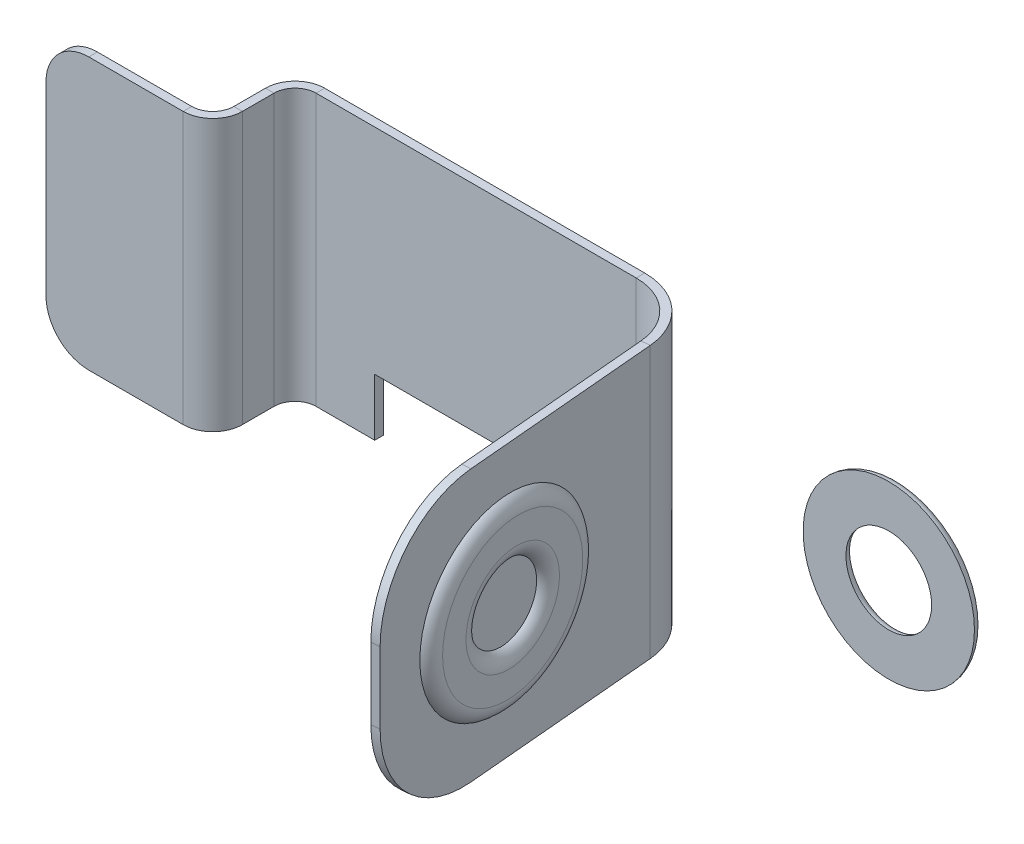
ISO-10303-21;
HEADER;
FILE_DESCRIPTION(('STEP AP214'),'2;1');
FILE_NAME('part.step','',(''),(''),'','','');
FILE_SCHEMA(('AUTOMOTIVE_DESIGN { 1 0 10303 214 1 1 1 1 }'));
ENDSEC;
DATA;
#1=APPLICATION_CONTEXT('core data for automotive mechanical design processes');
#2=APPLICATION_PROTOCOL_DEFINITION('international standard','automotive_design',2000,#1);
#3=PRODUCT_CONTEXT('',#1,'mechanical');
#4=PRODUCT('Part','Part','',(#3));
#5=PRODUCT_RELATED_PRODUCT_CATEGORY('part','',(#4));
#6=PRODUCT_DEFINITION_FORMATION('','',#4);
#7=PRODUCT_DEFINITION_CONTEXT('part definition',#1,'design');
#8=PRODUCT_DEFINITION('design','',#6,#7);
#9=PRODUCT_DEFINITION_SHAPE('','',#8);
#10=(LENGTH_UNIT() NAMED_UNIT(*) SI_UNIT(.MILLI.,.METRE.));
#11=(NAMED_UNIT(*) PLANE_ANGLE_UNIT() SI_UNIT($,.RADIAN.));
#12=(NAMED_UNIT(*) SI_UNIT($,.STERADIAN.) SOLID_ANGLE_UNIT());
#13=UNCERTAINTY_MEASURE_WITH_UNIT(LENGTH_MEASURE(1.E-05),#10,'distance_accuracy_value','');
#14=(GEOMETRIC_REPRESENTATION_CONTEXT(3) GLOBAL_UNCERTAINTY_ASSIGNED_CONTEXT((#13)) GLOBAL_UNIT_ASSIGNED_CONTEXT((#10,
#11,#12)) REPRESENTATION_CONTEXT('',''));
#15=CARTESIAN_POINT('',(0.,0.,0.));
#16=DIRECTION('',(0.,0.,1.));
#17=DIRECTION('',(1.,0.,0.));
#18=AXIS2_PLACEMENT_3D('',#15,#16,#17);
#19=CARTESIAN_POINT('',(2.11946802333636,1.50000000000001,3.18053197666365));
#20=DIRECTION('',(1.,0.,0.));
#21=DIRECTION('',(0.,0.,-1.));
#22=AXIS2_PLACEMENT_3D('',#19,#20,#21);
#23=PLANE('',#22);
#24=DIRECTION('',(0.,-1.,0.));
#25=VECTOR('',#24,1.);
#26=CARTESIAN_POINT('',(2.11946802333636,1.50000000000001,2.88053197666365));
#27=LINE('',#26,#25);
#28=CARTESIAN_POINT('',(2.11946802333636,7.99999999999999,2.88053197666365));
#29=VERTEX_POINT('',#28);
#30=CARTESIAN_POINT('',(2.11946802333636,1.50000000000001,2.88053197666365));
#31=VERTEX_POINT('',#30);
#32=EDGE_CURVE('E58',#29,#31,#27,.T.);
#33=ORIENTED_EDGE('',*,*,#32,.T.);
#34=DIRECTION('',(0.,0.,-1.));
#35=VECTOR('',#34,1.);
#36=CARTESIAN_POINT('',(2.11946802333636,1.50000000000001,3.18053197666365));
#37=LINE('',#36,#35);
#38=CARTESIAN_POINT('',(2.11946802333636,1.50000000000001,3.18053197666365));
#39=VERTEX_POINT('',#38);
#40=EDGE_CURVE('E452',#39,#31,#37,.T.);
#41=ORIENTED_EDGE('',*,*,#40,.F.);
#42=DIRECTION('',(0.,-1.,0.));
#43=VECTOR('',#42,1.);
#44=CARTESIAN_POINT('',(2.11946802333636,1.50000000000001,3.18053197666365));
#45=LINE('',#44,#43);
#46=CARTESIAN_POINT('',(2.11946802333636,7.99999999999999,3.18053197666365));
#47=VERTEX_POINT('',#46);
#48=EDGE_CURVE('E440',#47,#39,#45,.T.);
#49=ORIENTED_EDGE('',*,*,#48,.F.);
#50=DIRECTION('',(0.,0.,-1.));
#51=VECTOR('',#50,1.);
#52=CARTESIAN_POINT('',(2.11946802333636,7.99999999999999,3.18053197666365));
#53=LINE('',#52,#51);
#54=EDGE_CURVE('E463',#47,#29,#53,.T.);
#55=ORIENTED_EDGE('',*,*,#54,.T.);
#56=EDGE_LOOP('',(#33,#41,#49,#55));
#57=FACE_BOUND('',#56,.T.);
#58=ADVANCED_FACE('F39',(#57),#23,.F.);
#59=CARTESIAN_POINT('',(3.61946802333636,8.,3.18053197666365));
#60=DIRECTION('',(0.,0.,-1.));
#61=DIRECTION('',(-1.,0.,0.));
#62=AXIS2_PLACEMENT_3D('',#59,#60,#61);
#63=CYLINDRICAL_SURFACE('',#62,1.5);
#64=CARTESIAN_POINT('',(3.61946802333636,8.,2.88053197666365));
#65=DIRECTION('',(0.,0.,1.));
#66=DIRECTION('',(-1.,0.,0.));
#67=AXIS2_PLACEMENT_3D('',#64,#65,#66);
#68=CIRCLE('',#67,1.5);
#69=CARTESIAN_POINT('',(3.61946802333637,9.5,2.88053197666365));
#70=VERTEX_POINT('',#69);
#71=EDGE_CURVE('E460',#70,#29,#68,.T.);
#72=ORIENTED_EDGE('',*,*,#71,.T.);
#73=ORIENTED_EDGE('',*,*,#54,.F.);
#74=CARTESIAN_POINT('',(3.61946802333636,8.,3.18053197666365));
#75=DIRECTION('',(0.,0.,1.));
#76=DIRECTION('',(-1.,0.,0.));
#77=AXIS2_PLACEMENT_3D('',#74,#75,#76);
#78=CIRCLE('',#77,1.5);
#79=CARTESIAN_POINT('',(3.61946802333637,9.5,3.18053197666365));
#80=VERTEX_POINT('',#79);
#81=EDGE_CURVE('E442',#80,#47,#78,.T.);
#82=ORIENTED_EDGE('',*,*,#81,.F.);
#83=DIRECTION('',(0.,0.,-1.));
#84=VECTOR('',#83,1.);
#85=CARTESIAN_POINT('',(3.61946802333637,9.5,3.18053197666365));
#86=LINE('',#85,#84);
#87=EDGE_CURVE('E457',#80,#70,#86,.T.);
#88=ORIENTED_EDGE('',*,*,#87,.T.);
#89=EDGE_LOOP('',(#72,#73,#82,#88));
#90=FACE_BOUND('',#89,.T.);
#91=ADVANCED_FACE('F545',(#90),#63,.T.);
#92=CARTESIAN_POINT('',(3.61946802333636,1.5,3.18053197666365));
#93=DIRECTION('',(0.,0.,-1.));
#94=DIRECTION('',(-1.,0.,0.));
#95=AXIS2_PLACEMENT_3D('',#92,#93,#94);
#96=CYLINDRICAL_SURFACE('',#95,1.5);
#97=CARTESIAN_POINT('',(3.61946802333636,1.5,2.88053197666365));
#98=DIRECTION('',(0.,0.,1.));
#99=DIRECTION('',(-1.,0.,0.));
#100=AXIS2_PLACEMENT_3D('',#97,#98,#99);
#101=CIRCLE('',#100,1.5);
#102=CARTESIAN_POINT('',(3.61946802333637,0.,2.88053197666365));
#103=VERTEX_POINT('',#102);
#104=EDGE_CURVE('E455',#31,#103,#101,.T.);
#105=ORIENTED_EDGE('',*,*,#104,.T.);
#106=DIRECTION('',(0.,0.,-1.));
#107=VECTOR('',#106,1.);
#108=CARTESIAN_POINT('',(3.61946802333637,0.,3.18053197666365));
#109=LINE('',#108,#107);
#110=CARTESIAN_POINT('',(3.61946802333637,0.,3.18053197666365));
#111=VERTEX_POINT('',#110);
#112=EDGE_CURVE('E449',#111,#103,#109,.T.);
#113=ORIENTED_EDGE('',*,*,#112,.F.);
#114=CARTESIAN_POINT('',(3.61946802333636,1.5,3.18053197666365));
#115=DIRECTION('',(0.,0.,1.));
#116=DIRECTION('',(-1.,0.,0.));
#117=AXIS2_PLACEMENT_3D('',#114,#115,#116);
#118=CIRCLE('',#117,1.5);
#119=EDGE_CURVE('E438',#39,#111,#118,.T.);
#120=ORIENTED_EDGE('',*,*,#119,.F.);
#121=ORIENTED_EDGE('',*,*,#40,.T.);
#122=EDGE_LOOP('',(#105,#113,#120,#121));
#123=FACE_BOUND('',#122,.T.);
#124=ADVANCED_FACE('F551',(#123),#96,.T.);
#125=CARTESIAN_POINT('',(12.8694680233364,0.,3.18053197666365));
#126=DIRECTION('',(0.,1.,0.));
#127=DIRECTION('',(-1.,0.,0.));
#128=AXIS2_PLACEMENT_3D('',#125,#126,#127);
#129=PLANE('',#128);
#130=DIRECTION('',(0.,0.,-1.));
#131=VECTOR('',#130,1.);
#132=CARTESIAN_POINT('',(6.92313401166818,0.,3.18053197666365));
#133=LINE('',#132,#131);
#134=CARTESIAN_POINT('',(6.92313401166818,0.,3.18053197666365));
#135=VERTEX_POINT('',#134);
#136=CARTESIAN_POINT('',(6.92313401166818,0.,2.88053197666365));
#137=VERTEX_POINT('',#136);
#138=EDGE_CURVE('E43',#135,#137,#133,.T.);
#139=ORIENTED_EDGE('',*,*,#138,.F.);
#140=DIRECTION('',(1.,0.,0.));
#141=VECTOR('',#140,1.);
#142=CARTESIAN_POINT('',(12.8694680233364,0.,3.18053197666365));
#143=LINE('',#142,#141);
#144=EDGE_CURVE('E436',#111,#135,#143,.T.);
#145=ORIENTED_EDGE('',*,*,#144,.F.);
#146=ORIENTED_EDGE('',*,*,#112,.T.);
#147=DIRECTION('',(1.,0.,0.));
#148=VECTOR('',#147,1.);
#149=CARTESIAN_POINT('',(12.8694680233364,0.,2.88053197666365));
#150=LINE('',#149,#148);
#151=EDGE_CURVE('E447',#103,#137,#150,.T.);
#152=ORIENTED_EDGE('',*,*,#151,.T.);
#153=EDGE_LOOP('',(#139,#145,#146,#152));
#154=FACE_BOUND('',#153,.T.);
#155=ADVANCED_FACE('F559',(#154),#129,.F.);
#156=CARTESIAN_POINT('',(3.61946802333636,8.,3.18053197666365));
#157=DIRECTION('',(0.,0.,-1.));
#158=DIRECTION('',(-1.,0.,0.));
#159=AXIS2_PLACEMENT_3D('',#156,#157,#158);
#160=PLANE('',#159);
#161=DIRECTION('',(0.,-1.,0.));
#162=VECTOR('',#161,1.);
#163=CARTESIAN_POINT('',(6.92313401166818,8.,3.18053197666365));
#164=LINE('',#163,#162);
#165=CARTESIAN_POINT('',(6.92313401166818,9.5,3.18053197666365));
#166=VERTEX_POINT('',#165);
#167=EDGE_CURVE('E90',#166,#135,#164,.T.);
#168=ORIENTED_EDGE('',*,*,#167,.F.);
#169=DIRECTION('',(-1.,0.,0.));
#170=VECTOR('',#169,1.);
#171=CARTESIAN_POINT('',(3.61946802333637,9.5,3.18053197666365));
#172=LINE('',#171,#170);
#173=EDGE_CURVE('E445',#166,#80,#172,.T.);
#174=ORIENTED_EDGE('',*,*,#173,.T.);
#175=ORIENTED_EDGE('',*,*,#81,.T.);
#176=ORIENTED_EDGE('',*,*,#48,.T.);
#177=ORIENTED_EDGE('',*,*,#119,.T.);
#178=ORIENTED_EDGE('',*,*,#144,.T.);
#179=EDGE_LOOP('',(#168,#174,#175,#176,#177,#178));
#180=FACE_BOUND('',#179,.T.);
#181=ADVANCED_FACE('F563',(#180),#160,.F.);
#182=CARTESIAN_POINT('',(3.61946802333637,9.5,3.18053197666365));
#183=DIRECTION('',(0.,-1.,0.));
#184=DIRECTION('',(1.,0.,0.));
#185=AXIS2_PLACEMENT_3D('',#182,#183,#184);
#186=PLANE('',#185);
#187=DIRECTION('',(0.,0.,1.));
#188=VECTOR('',#187,1.);
#189=CARTESIAN_POINT('',(6.92313401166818,9.5,3.18053197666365));
#190=LINE('',#189,#188);
#191=CARTESIAN_POINT('',(6.92313401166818,9.5,2.88053197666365));
#192=VERTEX_POINT('',#191);
#193=EDGE_CURVE('E466',#192,#166,#190,.T.);
#194=ORIENTED_EDGE('',*,*,#193,.F.);
#195=DIRECTION('',(-1.,0.,0.));
#196=VECTOR('',#195,1.);
#197=CARTESIAN_POINT('',(3.61946802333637,9.5,2.88053197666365));
#198=LINE('',#197,#196);
#199=EDGE_CURVE('E49',#192,#70,#198,.T.);
#200=ORIENTED_EDGE('',*,*,#199,.T.);
#201=ORIENTED_EDGE('',*,*,#87,.F.);
#202=ORIENTED_EDGE('',*,*,#173,.F.);
#203=EDGE_LOOP('',(#194,#200,#201,#202));
#204=FACE_BOUND('',#203,.T.);
#205=ADVANCED_FACE('F566',(#204),#186,.F.);
#206=CARTESIAN_POINT('',(3.61946802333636,8.,2.88053197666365));
#207=DIRECTION('',(0.,0.,-1.));
#208=DIRECTION('',(-1.,0.,0.));
#209=AXIS2_PLACEMENT_3D('',#206,#207,#208);
#210=PLANE('',#209);
#211=ORIENTED_EDGE('',*,*,#199,.F.);
#212=DIRECTION('',(0.,-1.,0.));
#213=VECTOR('',#212,1.);
#214=CARTESIAN_POINT('',(6.92313401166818,8.,2.88053197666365));
#215=LINE('',#214,#213);
#216=EDGE_CURVE('E12',#192,#137,#215,.T.);
#217=ORIENTED_EDGE('',*,*,#216,.T.);
#218=ORIENTED_EDGE('',*,*,#151,.F.);
#219=ORIENTED_EDGE('',*,*,#104,.F.);
#220=ORIENTED_EDGE('',*,*,#32,.F.);
#221=ORIENTED_EDGE('',*,*,#71,.F.);
#222=EDGE_LOOP('',(#211,#217,#218,#219,#220,#221));
#223=FACE_BOUND('',#222,.T.);
#224=ADVANCED_FACE('F41',(#223),#210,.T.);
#225=CARTESIAN_POINT('',(7.6597340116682,8.,6.84026598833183));
#226=DIRECTION('',(-1.,0.,0.));
#227=DIRECTION('',(0.,0.,1.));
#228=AXIS2_PLACEMENT_3D('',#225,#226,#227);
#229=PLANE('',#228);
#230=DIRECTION('',(0.,-1.,0.));
#231=VECTOR('',#230,1.);
#232=CARTESIAN_POINT('',(7.65973401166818,8.,2.14393197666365));
#233=LINE('',#232,#231);
#234=CARTESIAN_POINT('',(7.65973401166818,9.5,2.14393197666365));
#235=VERTEX_POINT('',#234);
#236=CARTESIAN_POINT('',(7.65973401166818,0.,2.14393197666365));
#237=VERTEX_POINT('',#236);
#238=EDGE_CURVE('E232',#235,#237,#233,.T.);
#239=ORIENTED_EDGE('',*,*,#238,.F.);
#240=DIRECTION('',(0.,0.,1.));
#241=VECTOR('',#240,1.);
#242=CARTESIAN_POINT('',(7.6597340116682,9.5,6.84026598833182));
#243=LINE('',#242,#241);
#244=CARTESIAN_POINT('',(7.65973401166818,9.5,1.0366));
#245=VERTEX_POINT('',#244);
#246=EDGE_CURVE('E425',#245,#235,#243,.T.);
#247=ORIENTED_EDGE('',*,*,#246,.F.);
#248=DIRECTION('',(0.,-1.,0.));
#249=VECTOR('',#248,1.);
#250=CARTESIAN_POINT('',(7.65973401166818,8.,1.0366));
#251=LINE('',#250,#249);
#252=CARTESIAN_POINT('',(7.65973401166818,0.,1.0366));
#253=VERTEX_POINT('',#252);
#254=EDGE_CURVE('E234',#245,#253,#251,.T.);
#255=ORIENTED_EDGE('',*,*,#254,.T.);
#256=DIRECTION('',(0.,0.,-1.));
#257=VECTOR('',#256,1.);
#258=CARTESIAN_POINT('',(7.65973401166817,0.,-2.40973401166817));
#259=LINE('',#258,#257);
#260=EDGE_CURVE('E228',#237,#253,#259,.T.);
#261=ORIENTED_EDGE('',*,*,#260,.F.);
#262=EDGE_LOOP('',(#239,#247,#255,#261));
#263=FACE_BOUND('',#262,.T.);
#264=ADVANCED_FACE('F230',(#263),#229,.T.);
#265=CARTESIAN_POINT('',(7.95973401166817,0.,-2.40973401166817));
#266=DIRECTION('',(0.,1.,0.));
#267=DIRECTION('',(0.,0.,1.));
#268=AXIS2_PLACEMENT_3D('',#265,#266,#267);
#269=PLANE('',#268);
#270=DIRECTION('',(0.,0.,-1.));
#271=VECTOR('',#270,1.);
#272=CARTESIAN_POINT('',(7.95973401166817,0.,-2.40973401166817));
#273=LINE('',#272,#271);
#274=CARTESIAN_POINT('',(7.95973401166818,0.,2.14393197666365));
#275=VERTEX_POINT('',#274);
#276=CARTESIAN_POINT('',(7.95973401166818,0.,1.0366));
#277=VERTEX_POINT('',#276);
#278=EDGE_CURVE('E104',#275,#277,#273,.T.);
#279=ORIENTED_EDGE('',*,*,#278,.F.);
#280=DIRECTION('',(-1.,0.,0.));
#281=VECTOR('',#280,1.);
#282=CARTESIAN_POINT('',(7.95973401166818,0.,2.14393197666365));
#283=LINE('',#282,#281);
#284=EDGE_CURVE('E238',#275,#237,#283,.T.);
#285=ORIENTED_EDGE('',*,*,#284,.T.);
#286=ORIENTED_EDGE('',*,*,#260,.T.);
#287=DIRECTION('',(-1.,0.,0.));
#288=VECTOR('',#287,1.);
#289=CARTESIAN_POINT('',(7.95973401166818,0.,1.0366));
#290=LINE('',#289,#288);
#291=EDGE_CURVE('E254',#277,#253,#290,.T.);
#292=ORIENTED_EDGE('',*,*,#291,.F.);
#293=EDGE_LOOP('',(#279,#285,#286,#292));
#294=FACE_BOUND('',#293,.T.);
#295=ADVANCED_FACE('F241',(#294),#269,.F.);
#296=CARTESIAN_POINT('',(7.9597340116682,8.,6.84026598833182));
#297=DIRECTION('',(-1.,0.,0.));
#298=DIRECTION('',(0.,0.,1.));
#299=AXIS2_PLACEMENT_3D('',#296,#297,#298);
#300=PLANE('',#299);
#301=DIRECTION('',(0.,0.,1.));
#302=VECTOR('',#301,1.);
#303=CARTESIAN_POINT('',(7.9597340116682,9.5,6.84026598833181));
#304=LINE('',#303,#302);
#305=CARTESIAN_POINT('',(7.95973401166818,9.5,1.0366));
#306=VERTEX_POINT('',#305);
#307=CARTESIAN_POINT('',(7.95973401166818,9.5,2.14393197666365));
#308=VERTEX_POINT('',#307);
#309=EDGE_CURVE('E237',#306,#308,#304,.T.);
#310=ORIENTED_EDGE('',*,*,#309,.T.);
#311=DIRECTION('',(0.,-1.,0.));
#312=VECTOR('',#311,1.);
#313=CARTESIAN_POINT('',(7.95973401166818,8.,2.14393197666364));
#314=LINE('',#313,#312);
#315=EDGE_CURVE('E426',#308,#275,#314,.T.);
#316=ORIENTED_EDGE('',*,*,#315,.T.);
#317=ORIENTED_EDGE('',*,*,#278,.T.);
#318=DIRECTION('',(0.,-1.,0.));
#319=VECTOR('',#318,1.);
#320=CARTESIAN_POINT('',(7.95973401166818,8.,1.0366));
#321=LINE('',#320,#319);
#322=EDGE_CURVE('E119',#306,#277,#321,.T.);
#323=ORIENTED_EDGE('',*,*,#322,.F.);
#324=EDGE_LOOP('',(#310,#316,#317,#323));
#325=FACE_BOUND('',#324,.T.);
#326=ADVANCED_FACE('F476',(#325),#300,.F.);
#327=CARTESIAN_POINT('',(7.9597340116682,9.5,6.84026598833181));
#328=DIRECTION('',(0.,-1.,0.));
#329=DIRECTION('',(0.,0.,-1.));
#330=AXIS2_PLACEMENT_3D('',#327,#328,#329);
#331=PLANE('',#330);
#332=ORIENTED_EDGE('',*,*,#246,.T.);
#333=DIRECTION('',(1.,0.,0.));
#334=VECTOR('',#333,1.);
#335=CARTESIAN_POINT('',(7.95973401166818,9.5,2.14393197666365));
#336=LINE('',#335,#334);
#337=EDGE_CURVE('E423',#235,#308,#336,.T.);
#338=ORIENTED_EDGE('',*,*,#337,.T.);
#339=ORIENTED_EDGE('',*,*,#309,.F.);
#340=DIRECTION('',(1.,0.,0.));
#341=VECTOR('',#340,1.);
#342=CARTESIAN_POINT('',(7.95973401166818,9.5,1.0366));
#343=LINE('',#342,#341);
#344=EDGE_CURVE('E125',#245,#306,#343,.T.);
#345=ORIENTED_EDGE('',*,*,#344,.F.);
#346=EDGE_LOOP('',(#332,#338,#339,#345));
#347=FACE_BOUND('',#346,.T.);
#348=ADVANCED_FACE('F477',(#347),#331,.F.);
#349=CARTESIAN_POINT('',(20.3143428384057,8.,-19.4130780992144));
#350=DIRECTION('',(0.996194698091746,0.,-0.087155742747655));
#351=DIRECTION('',(-0.087155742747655,0.,-0.996194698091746));
#352=AXIS2_PLACEMENT_3D('',#349,#350,#351);
#353=PLANE('',#352);
#354=CARTESIAN_POINT('',(22.6893368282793,4.75,7.73322742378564));
#355=DIRECTION('',(0.996194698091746,0.,-0.087155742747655));
#356=DIRECTION('',(-0.087155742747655,0.,-0.996194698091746));
#357=AXIS2_PLACEMENT_3D('',#354,#355,#356);
#358=CIRCLE('',#357,3.21961524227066);
#359=CARTESIAN_POINT('',(22.4087288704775,4.75,4.52586378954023));
#360=VERTEX_POINT('',#359);
#361=EDGE_CURVE('E390',#360,#360,#358,.T.);
#362=ORIENTED_EDGE('',*,*,#361,.F.);
#363=EDGE_LOOP('',(#362));
#364=FACE_BOUND('',#363,.T.);
#365=DIRECTION('',(0.087155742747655,0.,0.996194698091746));
#366=VECTOR('',#365,1.);
#367=CARTESIAN_POINT('',(21.5563121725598,0.,-5.21730365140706));
#368=LINE('',#367,#366);
#369=CARTESIAN_POINT('',(22.1964532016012,0.,2.09954179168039));
#370=VERTEX_POINT('',#369);
#371=CARTESIAN_POINT('',(22.7982815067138,0.,8.97847079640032));
#372=VERTEX_POINT('',#371);
#373=EDGE_CURVE('E357',#370,#372,#368,.T.);
#374=ORIENTED_EDGE('',*,*,#373,.F.);
#375=DIRECTION('',(0.,1.,0.));
#376=VECTOR('',#375,1.);
#377=CARTESIAN_POINT('',(22.1964532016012,8.,2.09954179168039));
#378=LINE('',#377,#376);
#379=CARTESIAN_POINT('',(22.1964532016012,9.49999999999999,2.09954179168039));
#380=VERTEX_POINT('',#379);
#381=EDGE_CURVE('E408',#370,#380,#378,.T.);
#382=ORIENTED_EDGE('',*,*,#381,.T.);
#383=DIRECTION('',(-0.087155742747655,0.,-0.996194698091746));
#384=VECTOR('',#383,1.);
#385=CARTESIAN_POINT('',(20.3143428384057,9.5,-19.4130780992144));
#386=LINE('',#385,#384);
#387=CARTESIAN_POINT('',(22.7982815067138,9.5,8.97847079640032));
#388=VERTEX_POINT('',#387);
#389=EDGE_CURVE('E366',#388,#380,#386,.T.);
#390=ORIENTED_EDGE('',*,*,#389,.F.);
#391=CARTESIAN_POINT('',(22.7982815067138,6.,8.97847079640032));
#392=DIRECTION('',(-0.996194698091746,0.,0.087155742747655));
#393=DIRECTION('',(-0.087155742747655,0.,-0.996194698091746));
#394=AXIS2_PLACEMENT_3D('',#391,#392,#393);
#395=CIRCLE('',#394,3.5);
#396=CARTESIAN_POINT('',(23.1033266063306,6.,12.4651522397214));
#397=VERTEX_POINT('',#396);
#398=EDGE_CURVE('E364',#397,#388,#395,.T.);
#399=ORIENTED_EDGE('',*,*,#398,.F.);
#400=DIRECTION('',(0.,1.,0.));
#401=VECTOR('',#400,1.);
#402=CARTESIAN_POINT('',(23.1033266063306,3.5,12.4651522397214));
#403=LINE('',#402,#401);
#404=CARTESIAN_POINT('',(23.1033266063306,3.5,12.4651522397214));
#405=VERTEX_POINT('',#404);
#406=EDGE_CURVE('E362',#405,#397,#403,.T.);
#407=ORIENTED_EDGE('',*,*,#406,.F.);
#408=CARTESIAN_POINT('',(22.7982815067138,3.5,8.97847079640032));
#409=DIRECTION('',(-0.996194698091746,0.,0.087155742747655));
#410=DIRECTION('',(0.087155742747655,0.,0.996194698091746));
#411=AXIS2_PLACEMENT_3D('',#408,#409,#410);
#412=CIRCLE('',#411,3.5);
#413=EDGE_CURVE('E360',#372,#405,#412,.T.);
#414=ORIENTED_EDGE('',*,*,#413,.F.);
#415=EDGE_LOOP('',(#374,#382,#390,#399,#407,#414));
#416=FACE_BOUND('',#415,.T.);
#417=ADVANCED_FACE('F592',(#364,#416),#353,.T.);
#418=CARTESIAN_POINT('',(20.0154844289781,8.,-19.3869313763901));
#419=DIRECTION('',(0.996194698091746,0.,-0.087155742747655));
#420=DIRECTION('',(-0.087155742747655,0.,-0.996194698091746));
#421=AXIS2_PLACEMENT_3D('',#418,#419,#420);
#422=PLANE('',#421);
#423=DIRECTION('',(0.,1.,0.));
#424=VECTOR('',#423,1.);
#425=CARTESIAN_POINT('',(21.8975947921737,8.,2.12568851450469));
#426=LINE('',#425,#424);
#427=CARTESIAN_POINT('',(21.8975947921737,0.,2.12568851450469));
#428=VERTEX_POINT('',#427);
#429=CARTESIAN_POINT('',(21.8975947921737,9.5,2.12568851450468));
#430=VERTEX_POINT('',#429);
#431=EDGE_CURVE('E405',#428,#430,#426,.T.);
#432=ORIENTED_EDGE('',*,*,#431,.F.);
#433=DIRECTION('',(0.087155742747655,0.,0.996194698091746));
#434=VECTOR('',#433,1.);
#435=CARTESIAN_POINT('',(21.2574537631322,0.,-5.19115692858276));
#436=LINE('',#435,#434);
#437=CARTESIAN_POINT('',(22.4994230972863,0.,9.00461751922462));
#438=VERTEX_POINT('',#437);
#439=EDGE_CURVE('E370',#428,#438,#436,.T.);
#440=ORIENTED_EDGE('',*,*,#439,.T.);
#441=CARTESIAN_POINT('',(22.4994230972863,3.5,9.00461751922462));
#442=DIRECTION('',(-0.996194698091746,0.,0.087155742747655));
#443=DIRECTION('',(0.087155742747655,0.,0.996194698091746));
#444=AXIS2_PLACEMENT_3D('',#441,#442,#443);
#445=CIRCLE('',#444,3.5);
#446=CARTESIAN_POINT('',(22.8044681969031,3.5,12.4912989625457));
#447=VERTEX_POINT('',#446);
#448=EDGE_CURVE('E367',#438,#447,#445,.T.);
#449=ORIENTED_EDGE('',*,*,#448,.T.);
#450=DIRECTION('',(0.,1.,0.));
#451=VECTOR('',#450,1.);
#452=CARTESIAN_POINT('',(22.8044681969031,3.5,12.4912989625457));
#453=LINE('',#452,#451);
#454=CARTESIAN_POINT('',(22.8044681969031,6.,12.4912989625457));
#455=VERTEX_POINT('',#454);
#456=EDGE_CURVE('E369',#447,#455,#453,.T.);
#457=ORIENTED_EDGE('',*,*,#456,.T.);
#458=CARTESIAN_POINT('',(22.4994230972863,6.,9.00461751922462));
#459=DIRECTION('',(-0.996194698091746,0.,0.087155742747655));
#460=DIRECTION('',(-0.087155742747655,0.,-0.996194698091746));
#461=AXIS2_PLACEMENT_3D('',#458,#459,#460);
#462=CIRCLE('',#461,3.5);
#463=CARTESIAN_POINT('',(22.4994230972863,9.5,9.00461751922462));
#464=VERTEX_POINT('',#463);
#465=EDGE_CURVE('E372',#455,#464,#462,.T.);
#466=ORIENTED_EDGE('',*,*,#465,.T.);
#467=DIRECTION('',(-0.087155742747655,0.,-0.996194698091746));
#468=VECTOR('',#467,1.);
#469=CARTESIAN_POINT('',(20.0154844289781,9.5,-19.3869313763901));
#470=LINE('',#469,#468);
#471=EDGE_CURVE('E374',#464,#430,#470,.T.);
#472=ORIENTED_EDGE('',*,*,#471,.T.);
#473=EDGE_LOOP('',(#432,#440,#449,#457,#466,#472));
#474=FACE_BOUND('',#473,.T.);
#475=CARTESIAN_POINT('',(22.3904784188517,4.75,7.75937414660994));
#476=DIRECTION('',(0.996194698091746,0.,-0.087155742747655));
#477=DIRECTION('',(-0.087155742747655,0.,-0.996194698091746));
#478=AXIS2_PLACEMENT_3D('',#475,#476,#477);
#479=CIRCLE('',#478,3.21961524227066);
#480=CARTESIAN_POINT('',(22.10987046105,4.75,4.55201051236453));
#481=VERTEX_POINT('',#480);
#482=EDGE_CURVE('E396',#481,#481,#479,.T.);
#483=ORIENTED_EDGE('',*,*,#482,.T.);
#484=EDGE_LOOP('',(#483));
#485=FACE_BOUND('',#484,.T.);
#486=ADVANCED_FACE('F596',(#474,#485),#422,.F.);
#487=CARTESIAN_POINT('',(21.2574537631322,0.,-5.19115692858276));
#488=DIRECTION('',(0.,1.,0.));
#489=DIRECTION('',(-0.996194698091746,0.,0.087155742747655));
#490=AXIS2_PLACEMENT_3D('',#487,#488,#489);
#491=PLANE('',#490);
#492=DIRECTION('',(-0.996194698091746,0.,0.087155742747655));
#493=VECTOR('',#492,1.);
#494=CARTESIAN_POINT('',(21.8975947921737,0.,2.12568851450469));
#495=LINE('',#494,#493);
#496=EDGE_CURVE('E133',#370,#428,#495,.T.);
#497=ORIENTED_EDGE('',*,*,#496,.F.);
#498=ORIENTED_EDGE('',*,*,#373,.T.);
#499=DIRECTION('',(0.996194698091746,0.,-0.087155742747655));
#500=VECTOR('',#499,1.);
#501=CARTESIAN_POINT('',(22.4994230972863,0.,9.00461751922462));
#502=LINE('',#501,#500);
#503=EDGE_CURVE('E384',#438,#372,#502,.T.);
#504=ORIENTED_EDGE('',*,*,#503,.F.);
#505=ORIENTED_EDGE('',*,*,#439,.F.);
#506=EDGE_LOOP('',(#497,#498,#504,#505));
#507=FACE_BOUND('',#506,.T.);
#508=ADVANCED_FACE('F603',(#507),#491,.F.);
#509=CARTESIAN_POINT('',(22.4994230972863,3.5,9.00461751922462));
#510=DIRECTION('',(0.996194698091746,0.,-0.087155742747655));
#511=DIRECTION('',(-0.087155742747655,0.,-0.996194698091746));
#512=AXIS2_PLACEMENT_3D('',#509,#510,#511);
#513=CYLINDRICAL_SURFACE('',#512,3.5);
#514=ORIENTED_EDGE('',*,*,#413,.T.);
#515=DIRECTION('',(0.996194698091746,0.,-0.087155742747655));
#516=VECTOR('',#515,1.);
#517=CARTESIAN_POINT('',(22.8044681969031,3.5,12.4912989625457));
#518=LINE('',#517,#516);
#519=EDGE_CURVE('E381',#447,#405,#518,.T.);
#520=ORIENTED_EDGE('',*,*,#519,.F.);
#521=ORIENTED_EDGE('',*,*,#448,.F.);
#522=ORIENTED_EDGE('',*,*,#503,.T.);
#523=EDGE_LOOP('',(#514,#520,#521,#522));
#524=FACE_BOUND('',#523,.T.);
#525=ADVANCED_FACE('F647',(#524),#513,.T.);
#526=CARTESIAN_POINT('',(22.8044681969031,3.5,12.4912989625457));
#527=DIRECTION('',(-0.087155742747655,0.,-0.996194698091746));
#528=DIRECTION('',(-0.996194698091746,0.,0.087155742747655));
#529=AXIS2_PLACEMENT_3D('',#526,#527,#528);
#530=PLANE('',#529);
#531=ORIENTED_EDGE('',*,*,#406,.T.);
#532=DIRECTION('',(0.996194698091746,0.,-0.087155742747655));
#533=VECTOR('',#532,1.);
#534=CARTESIAN_POINT('',(22.8044681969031,6.,12.4912989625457));
#535=LINE('',#534,#533);
#536=EDGE_CURVE('E378',#455,#397,#535,.T.);
#537=ORIENTED_EDGE('',*,*,#536,.F.);
#538=ORIENTED_EDGE('',*,*,#456,.F.);
#539=ORIENTED_EDGE('',*,*,#519,.T.);
#540=EDGE_LOOP('',(#531,#537,#538,#539));
#541=FACE_BOUND('',#540,.T.);
#542=ADVANCED_FACE('F644',(#541),#530,.F.);
#543=CARTESIAN_POINT('',(22.4994230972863,6.,9.00461751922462));
#544=DIRECTION('',(0.996194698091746,0.,-0.087155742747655));
#545=DIRECTION('',(-0.087155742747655,0.,-0.996194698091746));
#546=AXIS2_PLACEMENT_3D('',#543,#544,#545);
#547=CYLINDRICAL_SURFACE('',#546,3.5);
#548=ORIENTED_EDGE('',*,*,#398,.T.);
#549=DIRECTION('',(0.996194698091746,0.,-0.087155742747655));
#550=VECTOR('',#549,1.);
#551=CARTESIAN_POINT('',(22.4994230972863,9.5,9.00461751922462));
#552=LINE('',#551,#550);
#553=EDGE_CURVE('E375',#464,#388,#552,.T.);
#554=ORIENTED_EDGE('',*,*,#553,.F.);
#555=ORIENTED_EDGE('',*,*,#465,.F.);
#556=ORIENTED_EDGE('',*,*,#536,.T.);
#557=EDGE_LOOP('',(#548,#554,#555,#556));
#558=FACE_BOUND('',#557,.T.);
#559=ADVANCED_FACE('F639',(#558),#547,.T.);
#560=CARTESIAN_POINT('',(20.0154844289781,9.5,-19.3869313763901));
#561=DIRECTION('',(0.,-1.,0.));
#562=DIRECTION('',(0.087155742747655,0.,0.996194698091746));
#563=AXIS2_PLACEMENT_3D('',#560,#561,#562);
#564=PLANE('',#563);
#565=DIRECTION('',(0.996194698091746,0.,-0.087155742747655));
#566=VECTOR('',#565,1.);
#567=CARTESIAN_POINT('',(21.8975947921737,9.5,2.12568851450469));
#568=LINE('',#567,#566);
#569=EDGE_CURVE('E141',#430,#380,#568,.T.);
#570=ORIENTED_EDGE('',*,*,#569,.F.);
#571=ORIENTED_EDGE('',*,*,#471,.F.);
#572=ORIENTED_EDGE('',*,*,#553,.T.);
#573=ORIENTED_EDGE('',*,*,#389,.T.);
#574=EDGE_LOOP('',(#570,#571,#572,#573));
#575=FACE_BOUND('',#574,.T.);
#576=ADVANCED_FACE('F630',(#575),#564,.F.);
#577=CARTESIAN_POINT('',(22.9881952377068,4.75,7.70708070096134));
#578=DIRECTION('',(-0.996194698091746,0.,0.087155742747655));
#579=DIRECTION('',(0.087155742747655,0.,0.996194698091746));
#580=AXIS2_PLACEMENT_3D('',#577,#578,#579);
#581=PLANE('',#580);
#582=CARTESIAN_POINT('',(22.9881952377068,4.75,7.70708070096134));
#583=DIRECTION('',(-0.996194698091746,0.,0.087155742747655));
#584=DIRECTION('',(0.087155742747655,0.,0.996194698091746));
#585=AXIS2_PLACEMENT_3D('',#582,#583,#584);
#586=CIRCLE('',#585,2.7);
#587=CARTESIAN_POINT('',(23.2235157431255,4.75,10.3968063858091));
#588=VERTEX_POINT('',#587);
#589=EDGE_CURVE('E354',#588,#588,#586,.F.);
#590=ORIENTED_EDGE('',*,*,#589,.T.);
#591=EDGE_LOOP('',(#590));
#592=FACE_BOUND('',#591,.T.);
#593=CARTESIAN_POINT('',(22.9881952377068,4.75,7.70708070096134));
#594=DIRECTION('',(-0.996194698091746,0.,0.087155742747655));
#595=DIRECTION('',(0.087155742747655,0.,0.996194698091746));
#596=AXIS2_PLACEMENT_3D('',#593,#594,#595);
#597=CIRCLE('',#596,1.8);
#598=CARTESIAN_POINT('',(23.1450755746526,4.75,9.50023115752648));
#599=VERTEX_POINT('',#598);
#600=EDGE_CURVE('E353',#599,#599,#597,.T.);
#601=ORIENTED_EDGE('',*,*,#600,.T.);
#602=EDGE_LOOP('',(#601));
#603=FACE_BOUND('',#602,.T.);
#604=ADVANCED_FACE('F628',(#592,#603),#581,.F.);
#605=CARTESIAN_POINT('',(22.3904784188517,4.75,7.75937414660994));
#606=DIRECTION('',(-0.996194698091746,0.,0.087155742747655));
#607=DIRECTION('',(0.087155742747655,0.,0.996194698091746));
#608=AXIS2_PLACEMENT_3D('',#605,#606,#607);
#609=TOROIDAL_SURFACE('',#608,2.7,0.6);
#610=ORIENTED_EDGE('',*,*,#361,.T.);
#611=EDGE_LOOP('',(#610));
#612=FACE_BOUND('',#611,.T.);
#613=ORIENTED_EDGE('',*,*,#589,.F.);
#614=EDGE_LOOP('',(#613));
#615=FACE_BOUND('',#614,.T.);
#616=ADVANCED_FACE('F621',(#612,#615),#609,.T.);
#617=CARTESIAN_POINT('',(22.3904784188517,4.75,7.75937414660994));
#618=DIRECTION('',(-0.996194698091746,0.,0.087155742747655));
#619=DIRECTION('',(0.087155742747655,0.,0.996194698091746));
#620=AXIS2_PLACEMENT_3D('',#617,#618,#619);
#621=TOROIDAL_SURFACE('',#620,1.8,0.6);
#622=CARTESIAN_POINT('',(22.6893368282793,4.75,7.73322742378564));
#623=DIRECTION('',(-0.996194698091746,0.,0.087155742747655));
#624=DIRECTION('',(0.087155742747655,0.,0.996194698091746));
#625=AXIS2_PLACEMENT_3D('',#622,#623,#624);
#626=CIRCLE('',#625,1.28038475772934);
#627=CARTESIAN_POINT('',(22.8009297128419,4.75,9.00873993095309));
#628=VERTEX_POINT('',#627);
#629=EDGE_CURVE('E387',#628,#628,#626,.T.);
#630=ORIENTED_EDGE('',*,*,#629,.T.);
#631=EDGE_LOOP('',(#630));
#632=FACE_BOUND('',#631,.T.);
#633=ORIENTED_EDGE('',*,*,#600,.F.);
#634=EDGE_LOOP('',(#633));
#635=FACE_BOUND('',#634,.T.);
#636=ADVANCED_FACE('F612',(#632,#635),#621,.T.);
#637=ORIENTED_EDGE('',*,*,#629,.F.);
#638=EDGE_LOOP('',(#637));
#639=FACE_BOUND('',#638,.T.);
#640=ADVANCED_FACE('F599',(#639),#353,.T.);
#641=CARTESIAN_POINT('',(22.6893368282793,4.75,7.73322742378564));
#642=DIRECTION('',(-0.996194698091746,0.,0.087155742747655));
#643=DIRECTION('',(0.087155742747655,0.,0.996194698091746));
#644=AXIS2_PLACEMENT_3D('',#641,#642,#643);
#645=PLANE('',#644);
#646=CARTESIAN_POINT('',(22.6893368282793,4.75,7.73322742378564));
#647=DIRECTION('',(-0.996194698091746,0.,0.087155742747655));
#648=DIRECTION('',(0.087155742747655,0.,0.996194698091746));
#649=AXIS2_PLACEMENT_3D('',#646,#647,#648);
#650=CIRCLE('',#649,2.7);
#651=CARTESIAN_POINT('',(22.9246573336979,4.75,10.4229531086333));
#652=VERTEX_POINT('',#651);
#653=EDGE_CURVE('E350',#652,#652,#650,.F.);
#654=ORIENTED_EDGE('',*,*,#653,.F.);
#655=EDGE_LOOP('',(#654));
#656=FACE_BOUND('',#655,.T.);
#657=CARTESIAN_POINT('',(22.6893368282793,4.75,7.73322742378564));
#658=DIRECTION('',(-0.996194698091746,0.,0.087155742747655));
#659=DIRECTION('',(0.087155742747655,0.,0.996194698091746));
#660=AXIS2_PLACEMENT_3D('',#657,#658,#659);
#661=CIRCLE('',#660,1.8);
#662=CARTESIAN_POINT('',(22.846217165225,4.75,9.52637788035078));
#663=VERTEX_POINT('',#662);
#664=EDGE_CURVE('E293',#663,#663,#661,.T.);
#665=ORIENTED_EDGE('',*,*,#664,.F.);
#666=EDGE_LOOP('',(#665));
#667=FACE_BOUND('',#666,.T.);
#668=ADVANCED_FACE('F611',(#656,#667),#645,.T.);
#669=CARTESIAN_POINT('',(22.3904784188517,4.75,7.75937414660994));
#670=DIRECTION('',(-0.996194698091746,0.,0.087155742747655));
#671=DIRECTION('',(0.087155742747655,0.,0.996194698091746));
#672=AXIS2_PLACEMENT_3D('',#669,#670,#671);
#673=TOROIDAL_SURFACE('',#672,2.7,0.3);
#674=CARTESIAN_POINT('',(22.5399076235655,4.75,7.74630078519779));
#675=DIRECTION('',(-0.996194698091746,0.,0.087155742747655));
#676=DIRECTION('',(0.087155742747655,0.,0.996194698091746));
#677=AXIS2_PLACEMENT_3D('',#674,#675,#676);
#678=CIRCLE('',#677,2.95980762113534);
#679=CARTESIAN_POINT('',(22.7978718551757,4.75,10.6948454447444));
#680=VERTEX_POINT('',#679);
#681=EDGE_CURVE('E393',#680,#680,#678,.T.);
#682=ORIENTED_EDGE('',*,*,#681,.T.);
#683=EDGE_LOOP('',(#682));
#684=FACE_BOUND('',#683,.T.);
#685=ORIENTED_EDGE('',*,*,#653,.T.);
#686=EDGE_LOOP('',(#685));
#687=FACE_BOUND('',#686,.T.);
#688=ADVANCED_FACE('F618',(#684,#687),#673,.F.);
#689=CARTESIAN_POINT('',(22.3904784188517,4.75,7.75937414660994));
#690=DIRECTION('',(-0.996194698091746,0.,0.087155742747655));
#691=DIRECTION('',(0.087155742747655,0.,0.996194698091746));
#692=AXIS2_PLACEMENT_3D('',#689,#690,#691);
#693=TOROIDAL_SURFACE('',#692,1.8,0.3);
#694=CARTESIAN_POINT('',(22.5399076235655,4.75,7.74630078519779));
#695=DIRECTION('',(-0.996194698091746,0.,0.087155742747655));
#696=DIRECTION('',(0.087155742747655,0.,0.996194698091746));
#697=AXIS2_PLACEMENT_3D('',#694,#695,#696);
#698=CIRCLE('',#697,1.54019237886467);
#699=CARTESIAN_POINT('',(22.6741442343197,4.75,9.28063226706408));
#700=VERTEX_POINT('',#699);
#701=EDGE_CURVE('E402',#700,#700,#698,.F.);
#702=ORIENTED_EDGE('',*,*,#701,.T.);
#703=EDGE_LOOP('',(#702));
#704=FACE_BOUND('',#703,.T.);
#705=ORIENTED_EDGE('',*,*,#664,.T.);
#706=EDGE_LOOP('',(#705));
#707=FACE_BOUND('',#706,.T.);
#708=ADVANCED_FACE('F678',(#704,#707),#693,.F.);
#709=CARTESIAN_POINT('',(22.3904784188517,4.75,7.75937414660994));
#710=DIRECTION('',(0.996194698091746,0.,-0.087155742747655));
#711=DIRECTION('',(-0.087155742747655,0.,-0.996194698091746));
#712=AXIS2_PLACEMENT_3D('',#709,#710,#711);
#713=CIRCLE('',#712,1.28038475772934);
#714=CARTESIAN_POINT('',(22.2788855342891,4.75,6.48386163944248));
#715=VERTEX_POINT('',#714);
#716=EDGE_CURVE('E399',#715,#715,#713,.F.);
#717=ORIENTED_EDGE('',*,*,#716,.T.);
#718=EDGE_LOOP('',(#717));
#719=FACE_BOUND('',#718,.T.);
#720=ADVANCED_FACE('F605',(#719),#422,.F.);
#721=CARTESIAN_POINT('',(22.6893368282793,4.75,7.73322742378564));
#722=DIRECTION('',(0.996194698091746,0.,-0.087155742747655));
#723=DIRECTION('',(-0.087155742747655,0.,-0.996194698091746));
#724=AXIS2_PLACEMENT_3D('',#721,#722,#723);
#725=TOROIDAL_SURFACE('',#724,3.21961524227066,0.3);
#726=ORIENTED_EDGE('',*,*,#482,.F.);
#727=EDGE_LOOP('',(#726));
#728=FACE_BOUND('',#727,.T.);
#729=ORIENTED_EDGE('',*,*,#681,.F.);
#730=EDGE_LOOP('',(#729));
#731=FACE_BOUND('',#730,.T.);
#732=ADVANCED_FACE('F669',(#728,#731),#725,.T.);
#733=CARTESIAN_POINT('',(22.6893368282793,4.75,7.73322742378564));
#734=DIRECTION('',(-0.996194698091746,0.,0.087155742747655));
#735=DIRECTION('',(0.087155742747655,0.,0.996194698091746));
#736=AXIS2_PLACEMENT_3D('',#733,#734,#735);
#737=TOROIDAL_SURFACE('',#736,1.28038475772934,0.3);
#738=ORIENTED_EDGE('',*,*,#701,.F.);
#739=EDGE_LOOP('',(#738));
#740=FACE_BOUND('',#739,.T.);
#741=ORIENTED_EDGE('',*,*,#716,.F.);
#742=EDGE_LOOP('',(#741));
#743=FACE_BOUND('',#742,.T.);
#744=ADVANCED_FACE('F672',(#740,#743),#737,.T.);
#745=CARTESIAN_POINT('',(15.75,2.,0.3));
#746=DIRECTION('',(1.,0.,0.));
#747=DIRECTION('',(0.,1.,0.));
#748=AXIS2_PLACEMENT_3D('',#745,#746,#747);
#749=PLANE('',#748);
#750=DIRECTION('',(0.,-1.,0.));
#751=VECTOR('',#750,1.);
#752=CARTESIAN_POINT('',(15.75,2.,0.));
#753=LINE('',#752,#751);
#754=CARTESIAN_POINT('',(15.75,2.,0.));
#755=VERTEX_POINT('',#754);
#756=CARTESIAN_POINT('',(15.75,0.,0.));
#757=VERTEX_POINT('',#756);
#758=EDGE_CURVE('E341',#755,#757,#753,.T.);
#759=ORIENTED_EDGE('',*,*,#758,.T.);
#760=DIRECTION('',(0.,0.,-1.));
#761=VECTOR('',#760,1.);
#762=CARTESIAN_POINT('',(15.75,0.,0.3));
#763=LINE('',#762,#761);
#764=CARTESIAN_POINT('',(15.75,0.,0.3));
#765=VERTEX_POINT('',#764);
#766=EDGE_CURVE('E290',#765,#757,#763,.T.);
#767=ORIENTED_EDGE('',*,*,#766,.F.);
#768=DIRECTION('',(0.,-1.,0.));
#769=VECTOR('',#768,1.);
#770=CARTESIAN_POINT('',(15.75,2.,0.3));
#771=LINE('',#770,#769);
#772=CARTESIAN_POINT('',(15.75,2.,0.3));
#773=VERTEX_POINT('',#772);
#774=EDGE_CURVE('E313',#773,#765,#771,.T.);
#775=ORIENTED_EDGE('',*,*,#774,.F.);
#776=DIRECTION('',(0.,0.,-1.));
#777=VECTOR('',#776,1.);
#778=CARTESIAN_POINT('',(15.75,2.,0.3));
#779=LINE('',#778,#777);
#780=EDGE_CURVE('E338',#773,#755,#779,.T.);
#781=ORIENTED_EDGE('',*,*,#780,.T.);
#782=EDGE_LOOP('',(#759,#767,#775,#781));
#783=FACE_BOUND('',#782,.T.);
#784=ADVANCED_FACE('F507',(#783),#749,.F.);
#785=CARTESIAN_POINT('',(15.75,2.,0.3));
#786=DIRECTION('',(0.,1.,0.));
#787=DIRECTION('',(-1.,0.,0.));
#788=AXIS2_PLACEMENT_3D('',#785,#786,#787);
#789=PLANE('',#788);
#790=DIRECTION('',(1.,0.,0.));
#791=VECTOR('',#790,1.);
#792=CARTESIAN_POINT('',(15.75,2.,0.));
#793=LINE('',#792,#791);
#794=CARTESIAN_POINT('',(10.75,2.,0.));
#795=VERTEX_POINT('',#794);
#796=EDGE_CURVE('E336',#795,#755,#793,.T.);
#797=ORIENTED_EDGE('',*,*,#796,.T.);
#798=ORIENTED_EDGE('',*,*,#780,.F.);
#799=DIRECTION('',(1.,0.,0.));
#800=VECTOR('',#799,1.);
#801=CARTESIAN_POINT('',(15.75,2.,0.3));
#802=LINE('',#801,#800);
#803=CARTESIAN_POINT('',(10.75,2.,0.3));
#804=VERTEX_POINT('',#803);
#805=EDGE_CURVE('E315',#804,#773,#802,.T.);
#806=ORIENTED_EDGE('',*,*,#805,.F.);
#807=DIRECTION('',(0.,0.,-1.));
#808=VECTOR('',#807,1.);
#809=CARTESIAN_POINT('',(10.75,2.,0.3));
#810=LINE('',#809,#808);
#811=EDGE_CURVE('E333',#804,#795,#810,.T.);
#812=ORIENTED_EDGE('',*,*,#811,.T.);
#813=EDGE_LOOP('',(#797,#798,#806,#812));
#814=FACE_BOUND('',#813,.T.);
#815=ADVANCED_FACE('F503',(#814),#789,.F.);
#816=CARTESIAN_POINT('',(10.75,2.,0.3));
#817=DIRECTION('',(-1.,0.,0.));
#818=DIRECTION('',(0.,0.,1.));
#819=AXIS2_PLACEMENT_3D('',#816,#817,#818);
#820=PLANE('',#819);
#821=DIRECTION('',(0.,1.,0.));
#822=VECTOR('',#821,1.);
#823=CARTESIAN_POINT('',(10.75,2.,0.));
#824=LINE('',#823,#822);
#825=CARTESIAN_POINT('',(10.75,0.,0.));
#826=VERTEX_POINT('',#825);
#827=EDGE_CURVE('E331',#826,#795,#824,.T.);
#828=ORIENTED_EDGE('',*,*,#827,.T.);
#829=ORIENTED_EDGE('',*,*,#811,.F.);
#830=DIRECTION('',(0.,1.,0.));
#831=VECTOR('',#830,1.);
#832=CARTESIAN_POINT('',(10.75,2.,0.3));
#833=LINE('',#832,#831);
#834=CARTESIAN_POINT('',(10.75,0.,0.3));
#835=VERTEX_POINT('',#834);
#836=EDGE_CURVE('E317',#835,#804,#833,.T.);
#837=ORIENTED_EDGE('',*,*,#836,.F.);
#838=DIRECTION('',(0.,0.,-1.));
#839=VECTOR('',#838,1.);
#840=CARTESIAN_POINT('',(10.75,0.,0.3));
#841=LINE('',#840,#839);
#842=EDGE_CURVE('E328',#835,#826,#841,.T.);
#843=ORIENTED_EDGE('',*,*,#842,.T.);
#844=EDGE_LOOP('',(#828,#829,#837,#843));
#845=FACE_BOUND('',#844,.T.);
#846=ADVANCED_FACE('F497',(#845),#820,.F.);
#847=CARTESIAN_POINT('',(10.75,0.,0.3));
#848=DIRECTION('',(0.,1.,0.));
#849=DIRECTION('',(-1.,0.,0.));
#850=AXIS2_PLACEMENT_3D('',#847,#848,#849);
#851=PLANE('',#850);
#852=DIRECTION('',(1.,0.,0.));
#853=VECTOR('',#852,1.);
#854=CARTESIAN_POINT('',(10.75,0.,0.3));
#855=LINE('',#854,#853);
#856=CARTESIAN_POINT('',(8.69633401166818,0.,0.300000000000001));
#857=VERTEX_POINT('',#856);
#858=EDGE_CURVE('E319',#857,#835,#855,.T.);
#859=ORIENTED_EDGE('',*,*,#858,.F.);
#860=DIRECTION('',(0.,0.,-1.));
#861=VECTOR('',#860,1.);
#862=CARTESIAN_POINT('',(8.69633401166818,0.,0.3));
#863=LINE('',#862,#861);
#864=CARTESIAN_POINT('',(8.69633401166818,0.,0.));
#865=VERTEX_POINT('',#864);
#866=EDGE_CURVE('E324',#857,#865,#863,.T.);
#867=ORIENTED_EDGE('',*,*,#866,.T.);
#868=DIRECTION('',(1.,0.,0.));
#869=VECTOR('',#868,1.);
#870=CARTESIAN_POINT('',(10.75,0.,0.));
#871=LINE('',#870,#869);
#872=EDGE_CURVE('E327',#865,#826,#871,.T.);
#873=ORIENTED_EDGE('',*,*,#872,.T.);
#874=ORIENTED_EDGE('',*,*,#842,.F.);
#875=EDGE_LOOP('',(#859,#867,#873,#874));
#876=FACE_BOUND('',#875,.T.);
#877=ADVANCED_FACE('F491',(#876),#851,.F.);
#878=CARTESIAN_POINT('',(1.5,8.,0.3));
#879=DIRECTION('',(0.,0.,-1.));
#880=DIRECTION('',(-1.,0.,0.));
#881=AXIS2_PLACEMENT_3D('',#878,#879,#880);
#882=PLANE('',#881);
#883=DIRECTION('',(-1.,0.,0.));
#884=VECTOR('',#883,1.);
#885=CARTESIAN_POINT('',(1.50000000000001,9.5,0.3));
#886=LINE('',#885,#884);
#887=CARTESIAN_POINT('',(19.9052053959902,9.49999999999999,0.300000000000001));
#888=VERTEX_POINT('',#887);
#889=CARTESIAN_POINT('',(8.69633401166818,9.5,0.300000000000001));
#890=VERTEX_POINT('',#889);
#891=EDGE_CURVE('E323',#888,#890,#886,.T.);
#892=ORIENTED_EDGE('',*,*,#891,.T.);
#893=DIRECTION('',(0.,-1.,0.));
#894=VECTOR('',#893,1.);
#895=CARTESIAN_POINT('',(8.69633401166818,8.,0.3));
#896=LINE('',#895,#894);
#897=EDGE_CURVE('E320',#890,#857,#896,.T.);
#898=ORIENTED_EDGE('',*,*,#897,.T.);
#899=ORIENTED_EDGE('',*,*,#858,.T.);
#900=ORIENTED_EDGE('',*,*,#836,.T.);
#901=ORIENTED_EDGE('',*,*,#805,.T.);
#902=ORIENTED_EDGE('',*,*,#774,.T.);
#903=DIRECTION('',(1.,0.,0.));
#904=VECTOR('',#903,1.);
#905=CARTESIAN_POINT('',(15.75,0.,0.3));
#906=LINE('',#905,#904);
#907=CARTESIAN_POINT('',(19.9052053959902,0.,0.300000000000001));
#908=VERTEX_POINT('',#907);
#909=EDGE_CURVE('E310',#765,#908,#906,.T.);
#910=ORIENTED_EDGE('',*,*,#909,.T.);
#911=DIRECTION('',(0.,1.,0.));
#912=VECTOR('',#911,1.);
#913=CARTESIAN_POINT('',(19.9052053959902,8.,0.3));
#914=LINE('',#913,#912);
#915=EDGE_CURVE('E307',#908,#888,#914,.T.);
#916=ORIENTED_EDGE('',*,*,#915,.T.);
#917=EDGE_LOOP('',(#892,#898,#899,#900,#901,#902,#910,#916));
#918=FACE_BOUND('',#917,.T.);
#919=ADVANCED_FACE('F487',(#918),#882,.F.);
#920=CARTESIAN_POINT('',(1.50000000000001,9.5,0.3));
#921=DIRECTION('',(0.,-1.,0.));
#922=DIRECTION('',(1.,0.,0.));
#923=AXIS2_PLACEMENT_3D('',#920,#921,#922);
#924=PLANE('',#923);
#925=DIRECTION('',(-1.,0.,0.));
#926=VECTOR('',#925,1.);
#927=CARTESIAN_POINT('',(1.50000000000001,9.5,0.));
#928=LINE('',#927,#926);
#929=CARTESIAN_POINT('',(19.9052053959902,9.5,0.));
#930=VERTEX_POINT('',#929);
#931=CARTESIAN_POINT('',(8.69633401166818,9.5,0.));
#932=VERTEX_POINT('',#931);
#933=EDGE_CURVE('E306',#930,#932,#928,.T.);
#934=ORIENTED_EDGE('',*,*,#933,.T.);
#935=DIRECTION('',(0.,0.,1.));
#936=VECTOR('',#935,1.);
#937=CARTESIAN_POINT('',(8.69633401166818,9.5,0.3));
#938=LINE('',#937,#936);
#939=EDGE_CURVE('E303',#932,#890,#938,.T.);
#940=ORIENTED_EDGE('',*,*,#939,.T.);
#941=ORIENTED_EDGE('',*,*,#891,.F.);
#942=DIRECTION('',(0.,0.,-1.));
#943=VECTOR('',#942,1.);
#944=CARTESIAN_POINT('',(19.9052053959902,9.5,0.3));
#945=LINE('',#944,#943);
#946=EDGE_CURVE('E300',#888,#930,#945,.T.);
#947=ORIENTED_EDGE('',*,*,#946,.T.);
#948=EDGE_LOOP('',(#934,#940,#941,#947));
#949=FACE_BOUND('',#948,.T.);
#950=ADVANCED_FACE('F515',(#949),#924,.F.);
#951=CARTESIAN_POINT('',(1.5,8.,0.));
#952=DIRECTION('',(0.,0.,-1.));
#953=DIRECTION('',(-1.,0.,0.));
#954=AXIS2_PLACEMENT_3D('',#951,#952,#953);
#955=PLANE('',#954);
#956=DIRECTION('',(0.,-1.,0.));
#957=VECTOR('',#956,1.);
#958=CARTESIAN_POINT('',(8.69633401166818,8.,0.));
#959=LINE('',#958,#957);
#960=EDGE_CURVE('E343',#932,#865,#959,.T.);
#961=ORIENTED_EDGE('',*,*,#960,.F.);
#962=ORIENTED_EDGE('',*,*,#933,.F.);
#963=DIRECTION('',(0.,1.,0.));
#964=VECTOR('',#963,1.);
#965=CARTESIAN_POINT('',(19.9052053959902,8.,0.));
#966=LINE('',#965,#964);
#967=CARTESIAN_POINT('',(19.9052053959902,0.,0.));
#968=VERTEX_POINT('',#967);
#969=EDGE_CURVE('E287',#968,#930,#966,.T.);
#970=ORIENTED_EDGE('',*,*,#969,.F.);
#971=DIRECTION('',(1.,0.,0.));
#972=VECTOR('',#971,1.);
#973=CARTESIAN_POINT('',(15.75,0.,0.));
#974=LINE('',#973,#972);
#975=EDGE_CURVE('E297',#757,#968,#974,.T.);
#976=ORIENTED_EDGE('',*,*,#975,.F.);
#977=ORIENTED_EDGE('',*,*,#758,.F.);
#978=ORIENTED_EDGE('',*,*,#796,.F.);
#979=ORIENTED_EDGE('',*,*,#827,.F.);
#980=ORIENTED_EDGE('',*,*,#872,.F.);
#981=EDGE_LOOP('',(#961,#962,#970,#976,#977,#978,#979,#980));
#982=FACE_BOUND('',#981,.T.);
#983=ADVANCED_FACE('F522',(#982),#955,.T.);
#984=CARTESIAN_POINT('',(15.75,0.,0.3));
#985=DIRECTION('',(0.,1.,0.));
#986=DIRECTION('',(0.,0.,1.));
#987=AXIS2_PLACEMENT_3D('',#984,#985,#986);
#988=PLANE('',#987);
#989=ORIENTED_EDGE('',*,*,#975,.T.);
#990=DIRECTION('',(0.,0.,1.));
#991=VECTOR('',#990,1.);
#992=CARTESIAN_POINT('',(19.9052053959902,0.,0.3));
#993=LINE('',#992,#991);
#994=EDGE_CURVE('E294',#968,#908,#993,.T.);
#995=ORIENTED_EDGE('',*,*,#994,.T.);
#996=ORIENTED_EDGE('',*,*,#909,.F.);
#997=ORIENTED_EDGE('',*,*,#766,.T.);
#998=EDGE_LOOP('',(#989,#995,#996,#997));
#999=FACE_BOUND('',#998,.T.);
#1000=ADVANCED_FACE('F511',(#999),#988,.F.);
#1001=CARTESIAN_POINT('',(19.9052053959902,0.,2.3));
#1002=DIRECTION('',(0.,1.,0.));
#1003=DIRECTION('',(0.,0.,1.));
#1004=AXIS2_PLACEMENT_3D('',#1001,#1002,#1003);
#1005=PLANE('',#1004);
#1006=ORIENTED_EDGE('',*,*,#496,.T.);
#1007=CARTESIAN_POINT('',(19.9052053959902,0.,2.3));
#1008=DIRECTION('',(0.,1.,0.));
#1009=DIRECTION('',(0.,0.,1.));
#1010=AXIS2_PLACEMENT_3D('',#1007,#1008,#1009);
#1011=CIRCLE('',#1010,2.);
#1012=EDGE_CURVE('E276',#908,#428,#1011,.F.);
#1013=ORIENTED_EDGE('',*,*,#1012,.F.);
#1014=ORIENTED_EDGE('',*,*,#994,.F.);
#1015=CARTESIAN_POINT('',(19.9052053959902,0.,2.3));
#1016=DIRECTION('',(0.,1.,0.));
#1017=DIRECTION('',(0.,0.,1.));
#1018=AXIS2_PLACEMENT_3D('',#1015,#1016,#1017);
#1019=CIRCLE('',#1018,2.3);
#1020=EDGE_CURVE('E282',#968,#370,#1019,.F.);
#1021=ORIENTED_EDGE('',*,*,#1020,.T.);
#1022=EDGE_LOOP('',(#1006,#1013,#1014,#1021));
#1023=FACE_BOUND('',#1022,.T.);
#1024=ADVANCED_FACE('F530',(#1023),#1005,.F.);
#1025=CARTESIAN_POINT('',(19.9052053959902,9.5,2.3));
#1026=DIRECTION('',(0.,-1.,0.));
#1027=DIRECTION('',(0.,0.,-1.));
#1028=AXIS2_PLACEMENT_3D('',#1025,#1026,#1027);
#1029=PLANE('',#1028);
#1030=ORIENTED_EDGE('',*,*,#946,.F.);
#1031=CARTESIAN_POINT('',(19.9052053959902,9.49999999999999,2.3));
#1032=DIRECTION('',(0.,1.,0.));
#1033=DIRECTION('',(0.,0.,1.));
#1034=AXIS2_PLACEMENT_3D('',#1031,#1032,#1033);
#1035=CIRCLE('',#1034,2.);
#1036=EDGE_CURVE('E279',#430,#888,#1035,.T.);
#1037=ORIENTED_EDGE('',*,*,#1036,.F.);
#1038=ORIENTED_EDGE('',*,*,#569,.T.);
#1039=CARTESIAN_POINT('',(19.9052053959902,9.49999999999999,2.3));
#1040=DIRECTION('',(0.,1.,0.));
#1041=DIRECTION('',(0.,0.,1.));
#1042=AXIS2_PLACEMENT_3D('',#1039,#1040,#1041);
#1043=CIRCLE('',#1042,2.3);
#1044=EDGE_CURVE('E285',#380,#930,#1043,.T.);
#1045=ORIENTED_EDGE('',*,*,#1044,.T.);
#1046=EDGE_LOOP('',(#1030,#1037,#1038,#1045));
#1047=FACE_BOUND('',#1046,.T.);
#1048=ADVANCED_FACE('F535',(#1047),#1029,.F.);
#1049=CARTESIAN_POINT('',(19.9052053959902,-34.8261396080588,2.3));
#1050=DIRECTION('',(0.,1.,0.));
#1051=DIRECTION('',(0.,0.,1.));
#1052=AXIS2_PLACEMENT_3D('',#1049,#1050,#1051);
#1053=CYLINDRICAL_SURFACE('',#1052,2.3);
#1054=ORIENTED_EDGE('',*,*,#1044,.F.);
#1055=ORIENTED_EDGE('',*,*,#381,.F.);
#1056=ORIENTED_EDGE('',*,*,#1020,.F.);
#1057=ORIENTED_EDGE('',*,*,#969,.T.);
#1058=EDGE_LOOP('',(#1054,#1055,#1056,#1057));
#1059=FACE_BOUND('',#1058,.T.);
#1060=ADVANCED_FACE('F527',(#1059),#1053,.T.);
#1061=CARTESIAN_POINT('',(19.9052053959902,-34.8261396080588,2.3));
#1062=DIRECTION('',(0.,1.,0.));
#1063=DIRECTION('',(0.,0.,1.));
#1064=AXIS2_PLACEMENT_3D('',#1061,#1062,#1063);
#1065=CYLINDRICAL_SURFACE('',#1064,2.);
#1066=ORIENTED_EDGE('',*,*,#1036,.T.);
#1067=ORIENTED_EDGE('',*,*,#915,.F.);
#1068=ORIENTED_EDGE('',*,*,#1012,.T.);
#1069=ORIENTED_EDGE('',*,*,#431,.T.);
#1070=EDGE_LOOP('',(#1066,#1067,#1068,#1069));
#1071=FACE_BOUND('',#1070,.T.);
#1072=ADVANCED_FACE('F531',(#1071),#1065,.F.);
#1073=CARTESIAN_POINT('',(8.69633401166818,9.5,1.0366));
#1074=DIRECTION('',(0.,-1.,0.));
#1075=DIRECTION('',(0.,0.,-1.));
#1076=AXIS2_PLACEMENT_3D('',#1073,#1074,#1075);
#1077=PLANE('',#1076);
#1078=ORIENTED_EDGE('',*,*,#344,.T.);
#1079=CARTESIAN_POINT('',(8.69633401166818,9.5,1.0366));
#1080=DIRECTION('',(0.,-1.,0.));
#1081=DIRECTION('',(1.,0.,0.));
#1082=AXIS2_PLACEMENT_3D('',#1079,#1080,#1081);
#1083=CIRCLE('',#1082,0.736599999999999);
#1084=EDGE_CURVE('E267',#890,#306,#1083,.F.);
#1085=ORIENTED_EDGE('',*,*,#1084,.F.);
#1086=ORIENTED_EDGE('',*,*,#939,.F.);
#1087=CARTESIAN_POINT('',(8.69633401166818,9.5,1.0366));
#1088=DIRECTION('',(0.,-1.,0.));
#1089=DIRECTION('',(1.,0.,0.));
#1090=AXIS2_PLACEMENT_3D('',#1087,#1088,#1089);
#1091=CIRCLE('',#1090,1.0366);
#1092=EDGE_CURVE('E271',#932,#245,#1091,.F.);
#1093=ORIENTED_EDGE('',*,*,#1092,.T.);
#1094=EDGE_LOOP('',(#1078,#1085,#1086,#1093));
#1095=FACE_BOUND('',#1094,.T.);
#1096=ADVANCED_FACE('F480',(#1095),#1077,.F.);
#1097=CARTESIAN_POINT('',(8.69633401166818,0.,1.0366));
#1098=DIRECTION('',(0.,1.,0.));
#1099=DIRECTION('',(-1.,0.,0.));
#1100=AXIS2_PLACEMENT_3D('',#1097,#1098,#1099);
#1101=PLANE('',#1100);
#1102=ORIENTED_EDGE('',*,*,#866,.F.);
#1103=CARTESIAN_POINT('',(8.69633401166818,0.,1.0366));
#1104=DIRECTION('',(0.,-1.,0.));
#1105=DIRECTION('',(1.,0.,0.));
#1106=AXIS2_PLACEMENT_3D('',#1103,#1104,#1105);
#1107=CIRCLE('',#1106,0.736599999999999);
#1108=EDGE_CURVE('E268',#277,#857,#1107,.T.);
#1109=ORIENTED_EDGE('',*,*,#1108,.F.);
#1110=ORIENTED_EDGE('',*,*,#291,.T.);
#1111=CARTESIAN_POINT('',(8.69633401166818,0.,1.0366));
#1112=DIRECTION('',(0.,-1.,0.));
#1113=DIRECTION('',(1.,0.,0.));
#1114=AXIS2_PLACEMENT_3D('',#1111,#1112,#1113);
#1115=CIRCLE('',#1114,1.0366);
#1116=EDGE_CURVE('E274',#253,#865,#1115,.T.);
#1117=ORIENTED_EDGE('',*,*,#1116,.T.);
#1118=EDGE_LOOP('',(#1102,#1109,#1110,#1117));
#1119=FACE_BOUND('',#1118,.T.);
#1120=ADVANCED_FACE('F770',(#1119),#1101,.F.);
#1121=CARTESIAN_POINT('',(8.69633401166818,37.5307025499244,1.0366));
#1122=DIRECTION('',(0.,-1.,0.));
#1123=DIRECTION('',(1.,0.,0.));
#1124=AXIS2_PLACEMENT_3D('',#1121,#1122,#1123);
#1125=CYLINDRICAL_SURFACE('',#1124,1.0366);
#1126=ORIENTED_EDGE('',*,*,#1116,.F.);
#1127=ORIENTED_EDGE('',*,*,#254,.F.);
#1128=ORIENTED_EDGE('',*,*,#1092,.F.);
#1129=ORIENTED_EDGE('',*,*,#960,.T.);
#1130=EDGE_LOOP('',(#1126,#1127,#1128,#1129));
#1131=FACE_BOUND('',#1130,.T.);
#1132=ADVANCED_FACE('F520',(#1131),#1125,.T.);
#1133=CARTESIAN_POINT('',(8.69633401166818,37.5307025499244,1.0366));
#1134=DIRECTION('',(0.,-1.,0.));
#1135=DIRECTION('',(1.,0.,0.));
#1136=AXIS2_PLACEMENT_3D('',#1133,#1134,#1135);
#1137=CYLINDRICAL_SURFACE('',#1136,0.736599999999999);
#1138=ORIENTED_EDGE('',*,*,#1108,.T.);
#1139=ORIENTED_EDGE('',*,*,#897,.F.);
#1140=ORIENTED_EDGE('',*,*,#1084,.T.);
#1141=ORIENTED_EDGE('',*,*,#322,.T.);
#1142=EDGE_LOOP('',(#1138,#1139,#1140,#1141));
#1143=FACE_BOUND('',#1142,.T.);
#1144=ADVANCED_FACE('F483',(#1143),#1137,.F.);
#1145=CARTESIAN_POINT('',(6.92313401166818,0.,2.14393197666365));
#1146=DIRECTION('',(0.,-1.,0.));
#1147=DIRECTION('',(0.,0.,-1.));
#1148=AXIS2_PLACEMENT_3D('',#1145,#1146,#1147);
#1149=PLANE('',#1148);
#1150=ORIENTED_EDGE('',*,*,#138,.T.);
#1151=CARTESIAN_POINT('',(6.92313401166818,0.,2.14393197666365));
#1152=DIRECTION('',(0.,1.,0.));
#1153=DIRECTION('',(-1.,0.,0.));
#1154=AXIS2_PLACEMENT_3D('',#1151,#1152,#1153);
#1155=CIRCLE('',#1154,0.7366);
#1156=EDGE_CURVE('E251',#137,#237,#1155,.T.);
#1157=ORIENTED_EDGE('',*,*,#1156,.T.);
#1158=ORIENTED_EDGE('',*,*,#284,.F.);
#1159=CARTESIAN_POINT('',(6.92313401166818,0.,2.14393197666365));
#1160=DIRECTION('',(0.,1.,0.));
#1161=DIRECTION('',(-1.,0.,0.));
#1162=AXIS2_PLACEMENT_3D('',#1159,#1160,#1161);
#1163=CIRCLE('',#1162,1.0366);
#1164=EDGE_CURVE('E262',#135,#275,#1163,.T.);
#1165=ORIENTED_EDGE('',*,*,#1164,.F.);
#1166=EDGE_LOOP('',(#1150,#1157,#1158,#1165));
#1167=FACE_BOUND('',#1166,.T.);
#1168=ADVANCED_FACE('F257',(#1167),#1149,.T.);
#1169=CARTESIAN_POINT('',(6.92313401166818,9.5,2.14393197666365));
#1170=DIRECTION('',(0.,1.,0.));
#1171=DIRECTION('',(-1.,0.,0.));
#1172=AXIS2_PLACEMENT_3D('',#1169,#1170,#1171);
#1173=PLANE('',#1172);
#1174=ORIENTED_EDGE('',*,*,#337,.F.);
#1175=CARTESIAN_POINT('',(6.92313401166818,9.49999999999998,2.14393197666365));
#1176=DIRECTION('',(0.,1.,0.));
#1177=DIRECTION('',(-1.,0.,0.));
#1178=AXIS2_PLACEMENT_3D('',#1175,#1176,#1177);
#1179=CIRCLE('',#1178,0.7366);
#1180=EDGE_CURVE('E253',#235,#192,#1179,.F.);
#1181=ORIENTED_EDGE('',*,*,#1180,.T.);
#1182=ORIENTED_EDGE('',*,*,#193,.T.);
#1183=CARTESIAN_POINT('',(6.92313401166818,9.49999999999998,2.14393197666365));
#1184=DIRECTION('',(0.,1.,0.));
#1185=DIRECTION('',(-1.,0.,0.));
#1186=AXIS2_PLACEMENT_3D('',#1183,#1184,#1185);
#1187=CIRCLE('',#1186,1.0366);
#1188=EDGE_CURVE('E259',#308,#166,#1187,.F.);
#1189=ORIENTED_EDGE('',*,*,#1188,.F.);
#1190=EDGE_LOOP('',(#1174,#1181,#1182,#1189));
#1191=FACE_BOUND('',#1190,.T.);
#1192=ADVANCED_FACE('F471',(#1191),#1173,.T.);
#1193=CARTESIAN_POINT('',(6.92313401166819,-22.1039572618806,2.14393197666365));
#1194=DIRECTION('',(0.,1.,0.));
#1195=DIRECTION('',(-1.,0.,0.));
#1196=AXIS2_PLACEMENT_3D('',#1193,#1194,#1195);
#1197=CYLINDRICAL_SURFACE('',#1196,1.0366);
#1198=ORIENTED_EDGE('',*,*,#1188,.T.);
#1199=ORIENTED_EDGE('',*,*,#167,.T.);
#1200=ORIENTED_EDGE('',*,*,#1164,.T.);
#1201=ORIENTED_EDGE('',*,*,#315,.F.);
#1202=EDGE_LOOP('',(#1198,#1199,#1200,#1201));
#1203=FACE_BOUND('',#1202,.T.);
#1204=ADVANCED_FACE('F475',(#1203),#1197,.T.);
#1205=CARTESIAN_POINT('',(6.92313401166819,-22.1039572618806,2.14393197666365));
#1206=DIRECTION('',(0.,1.,0.));
#1207=DIRECTION('',(-1.,0.,0.));
#1208=AXIS2_PLACEMENT_3D('',#1205,#1206,#1207);
#1209=CYLINDRICAL_SURFACE('',#1208,0.7366);
#1210=ORIENTED_EDGE('',*,*,#1180,.F.);
#1211=ORIENTED_EDGE('',*,*,#238,.T.);
#1212=ORIENTED_EDGE('',*,*,#1156,.F.);
#1213=ORIENTED_EDGE('',*,*,#216,.F.);
#1214=EDGE_LOOP('',(#1210,#1211,#1212,#1213));
#1215=FACE_BOUND('',#1214,.T.);
#1216=ADVANCED_FACE('F250',(#1215),#1209,.F.);
#1217=CLOSED_SHELL('',(#58,#91,#124,#155,#181,#205,#224,#264,#295,#326,#348,#417,#486,#508,#525,
#542,#559,#576,#604,#616,#636,#640,#668,#688,#708,#720,#732,#744,#784,#815,#846,#877,#919,#950,
#983,#1000,#1024,#1048,#1060,#1072,#1096,#1120,#1132,#1144,#1168,#1192,#1204,#1216));
#1218=MANIFOLD_SOLID_BREP('B2',#1217);
#1219=CARTESIAN_POINT('',(28.75,4.75,0.));
#1220=DIRECTION('',(0.,0.,1.));
#1221=DIRECTION('',(1.,0.,0.));
#1222=AXIS2_PLACEMENT_3D('',#1219,#1220,#1221);
#1223=PLANE('',#1222);
#1224=CARTESIAN_POINT('',(28.75,4.75,0.));
#1225=DIRECTION('',(0.,0.,1.));
#1226=DIRECTION('',(1.,0.,0.));
#1227=AXIS2_PLACEMENT_3D('',#1224,#1225,#1226);
#1228=CIRCLE('',#1227,2.7);
#1229=CARTESIAN_POINT('',(31.45,4.75,0.));
#1230=VERTEX_POINT('',#1229);
#1231=EDGE_CURVE('E38',#1230,#1230,#1228,.F.);
#1232=ORIENTED_EDGE('',*,*,#1231,.T.);
#1233=EDGE_LOOP('',(#1232));
#1234=FACE_BOUND('',#1233,.T.);
#1235=CARTESIAN_POINT('',(28.75,4.75,0.));
#1236=DIRECTION('',(0.,0.,1.));
#1237=DIRECTION('',(1.,0.,0.));
#1238=AXIS2_PLACEMENT_3D('',#1235,#1236,#1237);
#1239=CIRCLE('',#1238,1.8);
#1240=CARTESIAN_POINT('',(30.55,4.75,0.));
#1241=VERTEX_POINT('',#1240);
#1242=EDGE_CURVE('E1005',#1241,#1241,#1239,.T.);
#1243=ORIENTED_EDGE('',*,*,#1242,.T.);
#1244=EDGE_LOOP('',(#1243));
#1245=FACE_BOUND('',#1244,.T.);
#1246=ADVANCED_FACE('F999',(#1234,#1245),#1223,.F.);
#1247=CARTESIAN_POINT('',(28.75,4.75,0.3));
#1248=DIRECTION('',(0.,0.,1.));
#1249=DIRECTION('',(1.,0.,0.));
#1250=AXIS2_PLACEMENT_3D('',#1247,#1248,#1249);
#1251=PLANE('',#1250);
#1252=CARTESIAN_POINT('',(28.75,4.75,0.3));
#1253=DIRECTION('',(0.,0.,1.));
#1254=DIRECTION('',(1.,0.,0.));
#1255=AXIS2_PLACEMENT_3D('',#1252,#1253,#1254);
#1256=CIRCLE('',#1255,1.5);
#1257=CARTESIAN_POINT('',(30.25,4.75,0.3));
#1258=VERTEX_POINT('',#1257);
#1259=EDGE_CURVE('E1013',#1258,#1258,#1256,.T.);
#1260=ORIENTED_EDGE('',*,*,#1259,.F.);
#1261=EDGE_LOOP('',(#1260));
#1262=FACE_BOUND('',#1261,.T.);
#1263=CARTESIAN_POINT('',(28.75,4.75,0.3));
#1264=DIRECTION('',(0.,0.,1.));
#1265=DIRECTION('',(1.,0.,0.));
#1266=AXIS2_PLACEMENT_3D('',#1263,#1264,#1265);
#1267=CIRCLE('',#1266,3.);
#1268=CARTESIAN_POINT('',(31.75,4.75,0.3));
#1269=VERTEX_POINT('',#1268);
#1270=EDGE_CURVE('E1009',#1269,#1269,#1267,.T.);
#1271=ORIENTED_EDGE('',*,*,#1270,.T.);
#1272=EDGE_LOOP('',(#1271));
#1273=FACE_BOUND('',#1272,.T.);
#1274=ADVANCED_FACE('F1022',(#1262,#1273),#1251,.T.);
#1275=CARTESIAN_POINT('',(28.75,4.75,0.3));
#1276=DIRECTION('',(0.,0.,1.));
#1277=DIRECTION('',(1.,0.,0.));
#1278=AXIS2_PLACEMENT_3D('',#1275,#1276,#1277);
#1279=TOROIDAL_SURFACE('',#1278,2.7,0.3);
#1280=ORIENTED_EDGE('',*,*,#1231,.F.);
#1281=EDGE_LOOP('',(#1280));
#1282=FACE_BOUND('',#1281,.T.);
#1283=ORIENTED_EDGE('',*,*,#1270,.F.);
#1284=EDGE_LOOP('',(#1283));
#1285=FACE_BOUND('',#1284,.T.);
#1286=ADVANCED_FACE('F1025',(#1282,#1285),#1279,.T.);
#1287=CARTESIAN_POINT('',(28.75,4.75,0.3));
#1288=DIRECTION('',(0.,0.,1.));
#1289=DIRECTION('',(1.,0.,0.));
#1290=AXIS2_PLACEMENT_3D('',#1287,#1288,#1289);
#1291=TOROIDAL_SURFACE('',#1290,1.8,0.3);
#1292=ORIENTED_EDGE('',*,*,#1259,.T.);
#1293=EDGE_LOOP('',(#1292));
#1294=FACE_BOUND('',#1293,.T.);
#1295=ORIENTED_EDGE('',*,*,#1242,.F.);
#1296=EDGE_LOOP('',(#1295));
#1297=FACE_BOUND('',#1296,.T.);
#1298=ADVANCED_FACE('F1019',(#1294,#1297),#1291,.T.);
#1299=CLOSED_SHELL('',(#1246,#1274,#1286,#1298));
#1300=MANIFOLD_SOLID_BREP('B6_NOT_SHOWN',#1299);
#1301=ADVANCED_BREP_SHAPE_REPRESENTATION('',(#18,#1218,#1300),#14);
#1302=SHAPE_DEFINITION_REPRESENTATION(#9,#1301);
ENDSEC;
END-ISO-10303-21;
